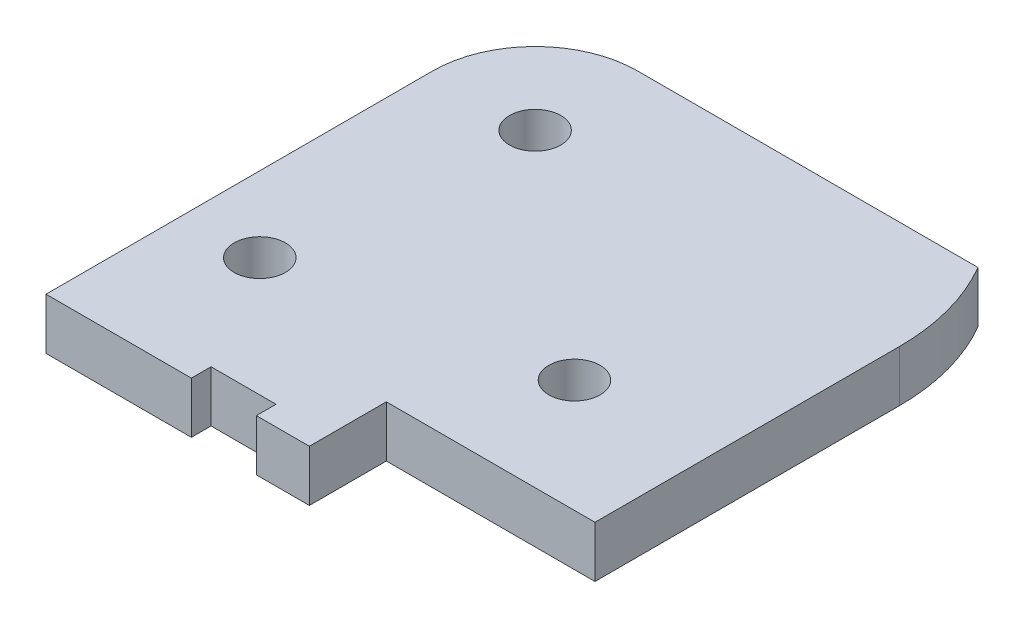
ISO-10303-21;
HEADER;
FILE_DESCRIPTION(('STEP AP214'),'2;1');
FILE_NAME('part.step','',(''),(''),'','','');
FILE_SCHEMA(('AUTOMOTIVE_DESIGN { 1 0 10303 214 1 1 1 1 }'));
ENDSEC;
DATA;
#1=APPLICATION_CONTEXT('core data for automotive mechanical design processes');
#2=APPLICATION_PROTOCOL_DEFINITION('international standard','automotive_design',2000,#1);
#3=PRODUCT_CONTEXT('',#1,'mechanical');
#4=PRODUCT('Part','Part','',(#3));
#5=PRODUCT_RELATED_PRODUCT_CATEGORY('part','',(#4));
#6=PRODUCT_DEFINITION_FORMATION('','',#4);
#7=PRODUCT_DEFINITION_CONTEXT('part definition',#1,'design');
#8=PRODUCT_DEFINITION('design','',#6,#7);
#9=PRODUCT_DEFINITION_SHAPE('','',#8);
#10=(LENGTH_UNIT() NAMED_UNIT(*) SI_UNIT(.MILLI.,.METRE.));
#11=(NAMED_UNIT(*) PLANE_ANGLE_UNIT() SI_UNIT($,.RADIAN.));
#12=(NAMED_UNIT(*) SI_UNIT($,.STERADIAN.) SOLID_ANGLE_UNIT());
#13=UNCERTAINTY_MEASURE_WITH_UNIT(LENGTH_MEASURE(1.E-05),#10,'distance_accuracy_value','');
#14=(GEOMETRIC_REPRESENTATION_CONTEXT(3) GLOBAL_UNCERTAINTY_ASSIGNED_CONTEXT((#13)) GLOBAL_UNIT_ASSIGNED_CONTEXT((#10,
#11,#12)) REPRESENTATION_CONTEXT('',''));
#15=CARTESIAN_POINT('',(0.,0.,0.));
#16=DIRECTION('',(0.,0.,1.));
#17=DIRECTION('',(1.,0.,0.));
#18=AXIS2_PLACEMENT_3D('',#15,#16,#17);
#19=CARTESIAN_POINT('',(-5.3,-1.5,14.3));
#20=DIRECTION('',(1.,0.,0.));
#21=DIRECTION('',(0.,0.,-1.));
#22=AXIS2_PLACEMENT_3D('',#19,#20,#21);
#23=PLANE('',#22);
#24=DIRECTION('',(0.,1.,0.));
#25=VECTOR('',#24,1.);
#26=CARTESIAN_POINT('',(-5.3,-1.5,14.3));
#27=LINE('',#26,#25);
#28=CARTESIAN_POINT('',(-5.3,-1.5,14.3));
#29=VERTEX_POINT('',#28);
#30=CARTESIAN_POINT('',(-5.3,1.5,14.3));
#31=VERTEX_POINT('',#30);
#32=EDGE_CURVE('E169',#29,#31,#27,.T.);
#33=ORIENTED_EDGE('',*,*,#32,.F.);
#34=DIRECTION('',(0.,0.,-1.));
#35=VECTOR('',#34,1.);
#36=CARTESIAN_POINT('',(-5.3,-1.5,14.3));
#37=LINE('',#36,#35);
#38=CARTESIAN_POINT('',(-5.3,-1.5,13.15));
#39=VERTEX_POINT('',#38);
#40=EDGE_CURVE('E113',#29,#39,#37,.T.);
#41=ORIENTED_EDGE('',*,*,#40,.T.);
#42=DIRECTION('',(0.,1.,0.));
#43=VECTOR('',#42,1.);
#44=CARTESIAN_POINT('',(-5.3,-1.5,13.15));
#45=LINE('',#44,#43);
#46=CARTESIAN_POINT('',(-5.3,1.5,13.15));
#47=VERTEX_POINT('',#46);
#48=EDGE_CURVE('E198',#47,#39,#45,.F.);
#49=ORIENTED_EDGE('',*,*,#48,.F.);
#50=DIRECTION('',(0.,0.,1.));
#51=VECTOR('',#50,1.);
#52=CARTESIAN_POINT('',(-5.3,1.5,0.));
#53=LINE('',#52,#51);
#54=EDGE_CURVE('E203',#31,#47,#53,.F.);
#55=ORIENTED_EDGE('',*,*,#54,.F.);
#56=EDGE_LOOP('',(#33,#41,#49,#55));
#57=FACE_BOUND('',#56,.T.);
#58=ADVANCED_FACE('F17',(#57),#23,.T.);
#59=CARTESIAN_POINT('',(-1.5,-1.5,13.15));
#60=DIRECTION('',(-1.,0.,0.));
#61=DIRECTION('',(0.,0.,1.));
#62=AXIS2_PLACEMENT_3D('',#59,#60,#61);
#63=PLANE('',#62);
#64=DIRECTION('',(0.,1.,0.));
#65=VECTOR('',#64,1.);
#66=CARTESIAN_POINT('',(-1.5,-1.5,13.15));
#67=LINE('',#66,#65);
#68=CARTESIAN_POINT('',(-1.5,-1.5,13.15));
#69=VERTEX_POINT('',#68);
#70=CARTESIAN_POINT('',(-1.5,1.5,13.15));
#71=VERTEX_POINT('',#70);
#72=EDGE_CURVE('E181',#69,#71,#67,.T.);
#73=ORIENTED_EDGE('',*,*,#72,.F.);
#74=DIRECTION('',(0.,0.,1.));
#75=VECTOR('',#74,1.);
#76=CARTESIAN_POINT('',(-1.5,-1.5,13.15));
#77=LINE('',#76,#75);
#78=CARTESIAN_POINT('',(-1.5,-1.5,14.3));
#79=VERTEX_POINT('',#78);
#80=EDGE_CURVE('E201',#69,#79,#77,.T.);
#81=ORIENTED_EDGE('',*,*,#80,.T.);
#82=DIRECTION('',(0.,1.,0.));
#83=VECTOR('',#82,1.);
#84=CARTESIAN_POINT('',(-1.5,-1.5,14.3));
#85=LINE('',#84,#83);
#86=CARTESIAN_POINT('',(-1.5,1.5,14.3));
#87=VERTEX_POINT('',#86);
#88=EDGE_CURVE('E163',#87,#79,#85,.F.);
#89=ORIENTED_EDGE('',*,*,#88,.F.);
#90=DIRECTION('',(0.,0.,1.));
#91=VECTOR('',#90,1.);
#92=CARTESIAN_POINT('',(-1.5,1.5,0.));
#93=LINE('',#92,#91);
#94=EDGE_CURVE('E172',#71,#87,#93,.T.);
#95=ORIENTED_EDGE('',*,*,#94,.F.);
#96=EDGE_LOOP('',(#73,#81,#89,#95));
#97=FACE_BOUND('',#96,.T.);
#98=ADVANCED_FACE('F400',(#97),#63,.T.);
#99=CARTESIAN_POINT('',(0.,1.5,0.));
#100=DIRECTION('',(0.,1.,0.));
#101=DIRECTION('',(0.,0.,1.));
#102=AXIS2_PLACEMENT_3D('',#99,#100,#101);
#103=PLANE('',#102);
#104=CARTESIAN_POINT('',(-7.8,1.5,-8.3));
#105=DIRECTION('',(0.,1.,0.));
#106=DIRECTION('',(0.,0.,1.));
#107=AXIS2_PLACEMENT_3D('',#104,#105,#106);
#108=CIRCLE('',#107,1.5);
#109=CARTESIAN_POINT('',(-7.8,1.5,-6.8));
#110=VERTEX_POINT('',#109);
#111=EDGE_CURVE('E244',#110,#110,#108,.F.);
#112=ORIENTED_EDGE('',*,*,#111,.T.);
#113=EDGE_LOOP('',(#112));
#114=FACE_BOUND('',#113,.T.);
#115=CARTESIAN_POINT('',(-9.4,1.5,6.2));
#116=DIRECTION('',(0.,1.,0.));
#117=DIRECTION('',(0.,0.,1.));
#118=AXIS2_PLACEMENT_3D('',#115,#116,#117);
#119=CIRCLE('',#118,1.5);
#120=CARTESIAN_POINT('',(-9.4,1.5,7.7));
#121=VERTEX_POINT('',#120);
#122=EDGE_CURVE('E247',#121,#121,#119,.F.);
#123=ORIENTED_EDGE('',*,*,#122,.T.);
#124=EDGE_LOOP('',(#123));
#125=FACE_BOUND('',#124,.T.);
#126=CARTESIAN_POINT('',(6.,1.5,3.2));
#127=DIRECTION('',(0.,1.,0.));
#128=DIRECTION('',(0.,0.,1.));
#129=AXIS2_PLACEMENT_3D('',#126,#127,#128);
#130=CIRCLE('',#129,1.5);
#131=CARTESIAN_POINT('',(6.,1.5,4.7));
#132=VERTEX_POINT('',#131);
#133=EDGE_CURVE('E250',#132,#132,#130,.F.);
#134=ORIENTED_EDGE('',*,*,#133,.T.);
#135=EDGE_LOOP('',(#134));
#136=FACE_BOUND('',#135,.T.);
#137=DIRECTION('',(0.,0.,1.));
#138=VECTOR('',#137,1.);
#139=CARTESIAN_POINT('',(-13.8,1.5,-8.3));
#140=LINE('',#139,#138);
#141=CARTESIAN_POINT('',(-13.8,1.5,14.3));
#142=VERTEX_POINT('',#141);
#143=CARTESIAN_POINT('',(-13.8,1.5,-8.3));
#144=VERTEX_POINT('',#143);
#145=EDGE_CURVE('E175',#142,#144,#140,.F.);
#146=ORIENTED_EDGE('',*,*,#145,.F.);
#147=DIRECTION('',(1.,0.,0.));
#148=VECTOR('',#147,1.);
#149=CARTESIAN_POINT('',(-13.8,1.5,14.3));
#150=LINE('',#149,#148);
#151=EDGE_CURVE('E171',#31,#142,#150,.F.);
#152=ORIENTED_EDGE('',*,*,#151,.F.);
#153=ORIENTED_EDGE('',*,*,#54,.T.);
#154=DIRECTION('',(1.,0.,0.));
#155=VECTOR('',#154,1.);
#156=CARTESIAN_POINT('',(-5.3,1.5,13.15));
#157=LINE('',#156,#155);
#158=EDGE_CURVE('E216',#71,#47,#157,.F.);
#159=ORIENTED_EDGE('',*,*,#158,.F.);
#160=ORIENTED_EDGE('',*,*,#94,.T.);
#161=DIRECTION('',(1.,0.,0.));
#162=VECTOR('',#161,1.);
#163=CARTESIAN_POINT('',(-1.5,1.5,14.3));
#164=LINE('',#163,#162);
#165=CARTESIAN_POINT('',(1.6,1.5,14.3));
#166=VERTEX_POINT('',#165);
#167=EDGE_CURVE('E166',#166,#87,#164,.F.);
#168=ORIENTED_EDGE('',*,*,#167,.F.);
#169=DIRECTION('',(0.,0.,-1.));
#170=VECTOR('',#169,1.);
#171=CARTESIAN_POINT('',(1.6,1.5,14.3));
#172=LINE('',#171,#170);
#173=CARTESIAN_POINT('',(1.6,1.5,9.8));
#174=VERTEX_POINT('',#173);
#175=EDGE_CURVE('E158',#174,#166,#172,.F.);
#176=ORIENTED_EDGE('',*,*,#175,.F.);
#177=DIRECTION('',(1.,0.,0.));
#178=VECTOR('',#177,1.);
#179=CARTESIAN_POINT('',(1.6,1.5,9.8));
#180=LINE('',#179,#178);
#181=CARTESIAN_POINT('',(13.8,1.5,9.8));
#182=VERTEX_POINT('',#181);
#183=EDGE_CURVE('E131',#182,#174,#180,.F.);
#184=ORIENTED_EDGE('',*,*,#183,.F.);
#185=DIRECTION('',(0.,0.,-1.));
#186=VECTOR('',#185,1.);
#187=CARTESIAN_POINT('',(13.8,1.5,9.8));
#188=LINE('',#187,#186);
#189=CARTESIAN_POINT('',(13.8,1.5,-8.));
#190=VERTEX_POINT('',#189);
#191=EDGE_CURVE('E72',#190,#182,#188,.F.);
#192=ORIENTED_EDGE('',*,*,#191,.F.);
#193=CARTESIAN_POINT('',(1.3,1.5,-8.));
#194=DIRECTION('',(0.,1.,0.));
#195=DIRECTION('',(0.,0.,1.));
#196=AXIS2_PLACEMENT_3D('',#193,#194,#195);
#197=CIRCLE('',#196,12.5);
#198=CARTESIAN_POINT('',(12.0962956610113,1.5,-14.3));
#199=VERTEX_POINT('',#198);
#200=EDGE_CURVE('E20',#199,#190,#197,.F.);
#201=ORIENTED_EDGE('',*,*,#200,.F.);
#202=DIRECTION('',(-1.,0.,0.));
#203=VECTOR('',#202,1.);
#204=CARTESIAN_POINT('',(12.09629566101,1.5,-14.3));
#205=LINE('',#204,#203);
#206=CARTESIAN_POINT('',(-7.8,1.5,-14.3));
#207=VERTEX_POINT('',#206);
#208=EDGE_CURVE('E59',#207,#199,#205,.F.);
#209=ORIENTED_EDGE('',*,*,#208,.F.);
#210=CARTESIAN_POINT('',(-7.8,1.5,-8.3));
#211=DIRECTION('',(0.,1.,0.));
#212=DIRECTION('',(0.,0.,1.));
#213=AXIS2_PLACEMENT_3D('',#210,#211,#212);
#214=CIRCLE('',#213,6.);
#215=EDGE_CURVE('E252',#144,#207,#214,.F.);
#216=ORIENTED_EDGE('',*,*,#215,.F.);
#217=EDGE_LOOP('',(#146,#152,#153,#159,#160,#168,#176,#184,#192,#201,#209,#216));
#218=FACE_BOUND('',#217,.T.);
#219=ADVANCED_FACE('F393',(#114,#125,#136,#218),#103,.T.);
#220=CARTESIAN_POINT('',(-13.8,-1.5,14.3));
#221=DIRECTION('',(0.,0.,1.));
#222=DIRECTION('',(1.,0.,0.));
#223=AXIS2_PLACEMENT_3D('',#220,#221,#222);
#224=PLANE('',#223);
#225=DIRECTION('',(0.,1.,0.));
#226=VECTOR('',#225,1.);
#227=CARTESIAN_POINT('',(-13.8,-1.5,14.3));
#228=LINE('',#227,#226);
#229=CARTESIAN_POINT('',(-13.8,-1.5,14.3));
#230=VERTEX_POINT('',#229);
#231=EDGE_CURVE('E177',#230,#142,#228,.T.);
#232=ORIENTED_EDGE('',*,*,#231,.F.);
#233=DIRECTION('',(1.,0.,0.));
#234=VECTOR('',#233,1.);
#235=CARTESIAN_POINT('',(0.,-1.5,14.3));
#236=LINE('',#235,#234);
#237=EDGE_CURVE('E117',#230,#29,#236,.T.);
#238=ORIENTED_EDGE('',*,*,#237,.T.);
#239=ORIENTED_EDGE('',*,*,#32,.T.);
#240=ORIENTED_EDGE('',*,*,#151,.T.);
#241=EDGE_LOOP('',(#232,#238,#239,#240));
#242=FACE_BOUND('',#241,.T.);
#243=ADVANCED_FACE('F282',(#242),#224,.T.);
#244=CARTESIAN_POINT('',(-5.3,-1.5,13.15));
#245=DIRECTION('',(0.,0.,1.));
#246=DIRECTION('',(1.,0.,0.));
#247=AXIS2_PLACEMENT_3D('',#244,#245,#246);
#248=PLANE('',#247);
#249=ORIENTED_EDGE('',*,*,#48,.T.);
#250=DIRECTION('',(1.,0.,0.));
#251=VECTOR('',#250,1.);
#252=CARTESIAN_POINT('',(0.,-1.5,13.15));
#253=LINE('',#252,#251);
#254=EDGE_CURVE('E150',#39,#69,#253,.T.);
#255=ORIENTED_EDGE('',*,*,#254,.T.);
#256=ORIENTED_EDGE('',*,*,#72,.T.);
#257=ORIENTED_EDGE('',*,*,#158,.T.);
#258=EDGE_LOOP('',(#249,#255,#256,#257));
#259=FACE_BOUND('',#258,.T.);
#260=ADVANCED_FACE('F378',(#259),#248,.T.);
#261=CARTESIAN_POINT('',(-1.5,-1.5,14.3));
#262=DIRECTION('',(0.,0.,1.));
#263=DIRECTION('',(1.,0.,0.));
#264=AXIS2_PLACEMENT_3D('',#261,#262,#263);
#265=PLANE('',#264);
#266=ORIENTED_EDGE('',*,*,#88,.T.);
#267=DIRECTION('',(1.,0.,0.));
#268=VECTOR('',#267,1.);
#269=CARTESIAN_POINT('',(0.,-1.5,14.3));
#270=LINE('',#269,#268);
#271=CARTESIAN_POINT('',(1.6,-1.5,14.3));
#272=VERTEX_POINT('',#271);
#273=EDGE_CURVE('E148',#79,#272,#270,.T.);
#274=ORIENTED_EDGE('',*,*,#273,.T.);
#275=DIRECTION('',(0.,1.,0.));
#276=VECTOR('',#275,1.);
#277=CARTESIAN_POINT('',(1.6,-1.5,14.3));
#278=LINE('',#277,#276);
#279=EDGE_CURVE('E147',#166,#272,#278,.F.);
#280=ORIENTED_EDGE('',*,*,#279,.F.);
#281=ORIENTED_EDGE('',*,*,#167,.T.);
#282=EDGE_LOOP('',(#266,#274,#280,#281));
#283=FACE_BOUND('',#282,.T.);
#284=ADVANCED_FACE('F371',(#283),#265,.T.);
#285=CARTESIAN_POINT('',(1.6,-1.5,14.3));
#286=DIRECTION('',(1.,0.,0.));
#287=DIRECTION('',(0.,0.,-1.));
#288=AXIS2_PLACEMENT_3D('',#285,#286,#287);
#289=PLANE('',#288);
#290=ORIENTED_EDGE('',*,*,#279,.T.);
#291=DIRECTION('',(0.,0.,1.));
#292=VECTOR('',#291,1.);
#293=CARTESIAN_POINT('',(1.6,-1.5,0.));
#294=LINE('',#293,#292);
#295=CARTESIAN_POINT('',(1.6,-1.5,9.8));
#296=VERTEX_POINT('',#295);
#297=EDGE_CURVE('E140',#272,#296,#294,.F.);
#298=ORIENTED_EDGE('',*,*,#297,.T.);
#299=DIRECTION('',(0.,1.,0.));
#300=VECTOR('',#299,1.);
#301=CARTESIAN_POINT('',(1.6,-1.5,9.8));
#302=LINE('',#301,#300);
#303=EDGE_CURVE('E127',#174,#296,#302,.F.);
#304=ORIENTED_EDGE('',*,*,#303,.F.);
#305=ORIENTED_EDGE('',*,*,#175,.T.);
#306=EDGE_LOOP('',(#290,#298,#304,#305));
#307=FACE_BOUND('',#306,.T.);
#308=ADVANCED_FACE('F145',(#307),#289,.T.);
#309=CARTESIAN_POINT('',(1.6,-1.5,9.8));
#310=DIRECTION('',(0.,0.,1.));
#311=DIRECTION('',(1.,0.,0.));
#312=AXIS2_PLACEMENT_3D('',#309,#310,#311);
#313=PLANE('',#312);
#314=ORIENTED_EDGE('',*,*,#303,.T.);
#315=DIRECTION('',(1.,0.,0.));
#316=VECTOR('',#315,1.);
#317=CARTESIAN_POINT('',(0.,-1.5,9.8));
#318=LINE('',#317,#316);
#319=CARTESIAN_POINT('',(13.8,-1.5,9.8));
#320=VERTEX_POINT('',#319);
#321=EDGE_CURVE('E130',#296,#320,#318,.T.);
#322=ORIENTED_EDGE('',*,*,#321,.T.);
#323=DIRECTION('',(0.,1.,0.));
#324=VECTOR('',#323,1.);
#325=CARTESIAN_POINT('',(13.8,-1.5,9.8));
#326=LINE('',#325,#324);
#327=EDGE_CURVE('E121',#182,#320,#326,.F.);
#328=ORIENTED_EDGE('',*,*,#327,.F.);
#329=ORIENTED_EDGE('',*,*,#183,.T.);
#330=EDGE_LOOP('',(#314,#322,#328,#329));
#331=FACE_BOUND('',#330,.T.);
#332=ADVANCED_FACE('F129',(#331),#313,.T.);
#333=CARTESIAN_POINT('',(13.8,-1.5,9.8));
#334=DIRECTION('',(1.,0.,0.));
#335=DIRECTION('',(0.,0.,-1.));
#336=AXIS2_PLACEMENT_3D('',#333,#334,#335);
#337=PLANE('',#336);
#338=ORIENTED_EDGE('',*,*,#327,.T.);
#339=DIRECTION('',(0.,0.,1.));
#340=VECTOR('',#339,1.);
#341=CARTESIAN_POINT('',(13.8,-1.5,0.));
#342=LINE('',#341,#340);
#343=CARTESIAN_POINT('',(13.8,-1.5,-8.));
#344=VERTEX_POINT('',#343);
#345=EDGE_CURVE('E143',#320,#344,#342,.F.);
#346=ORIENTED_EDGE('',*,*,#345,.T.);
#347=DIRECTION('',(0.,1.,0.));
#348=VECTOR('',#347,1.);
#349=CARTESIAN_POINT('',(13.8,-1.5,-8.));
#350=LINE('',#349,#348);
#351=EDGE_CURVE('E186',#190,#344,#350,.F.);
#352=ORIENTED_EDGE('',*,*,#351,.F.);
#353=ORIENTED_EDGE('',*,*,#191,.T.);
#354=EDGE_LOOP('',(#338,#346,#352,#353));
#355=FACE_BOUND('',#354,.T.);
#356=ADVANCED_FACE('F268',(#355),#337,.T.);
#357=CARTESIAN_POINT('',(1.3,-1.5,-8.));
#358=DIRECTION('',(0.,1.,0.));
#359=DIRECTION('',(0.,0.,1.));
#360=AXIS2_PLACEMENT_3D('',#357,#358,#359);
#361=CYLINDRICAL_SURFACE('',#360,12.5);
#362=ORIENTED_EDGE('',*,*,#351,.T.);
#363=CARTESIAN_POINT('',(1.3,-1.5,-8.));
#364=DIRECTION('',(0.,1.,0.));
#365=DIRECTION('',(0.,0.,1.));
#366=AXIS2_PLACEMENT_3D('',#363,#364,#365);
#367=CIRCLE('',#366,12.5);
#368=CARTESIAN_POINT('',(12.0962956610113,-1.5,-14.3));
#369=VERTEX_POINT('',#368);
#370=EDGE_CURVE('E241',#344,#369,#367,.T.);
#371=ORIENTED_EDGE('',*,*,#370,.T.);
#372=DIRECTION('',(0.,1.,0.));
#373=VECTOR('',#372,1.);
#374=CARTESIAN_POINT('',(12.09629566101,-1.5,-14.3));
#375=LINE('',#374,#373);
#376=EDGE_CURVE('E185',#199,#369,#375,.F.);
#377=ORIENTED_EDGE('',*,*,#376,.F.);
#378=ORIENTED_EDGE('',*,*,#200,.T.);
#379=EDGE_LOOP('',(#362,#371,#377,#378));
#380=FACE_BOUND('',#379,.T.);
#381=ADVANCED_FACE('F267',(#380),#361,.T.);
#382=CARTESIAN_POINT('',(12.09629566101,-1.5,-14.3));
#383=DIRECTION('',(0.,0.,-1.));
#384=DIRECTION('',(-1.,0.,0.));
#385=AXIS2_PLACEMENT_3D('',#382,#383,#384);
#386=PLANE('',#385);
#387=ORIENTED_EDGE('',*,*,#376,.T.);
#388=DIRECTION('',(1.,0.,0.));
#389=VECTOR('',#388,1.);
#390=CARTESIAN_POINT('',(0.,-1.5,-14.3));
#391=LINE('',#390,#389);
#392=CARTESIAN_POINT('',(-7.8,-1.5,-14.3));
#393=VERTEX_POINT('',#392);
#394=EDGE_CURVE('E240',#369,#393,#391,.F.);
#395=ORIENTED_EDGE('',*,*,#394,.T.);
#396=DIRECTION('',(0.,1.,0.));
#397=VECTOR('',#396,1.);
#398=CARTESIAN_POINT('',(-7.8,-1.5,-14.3));
#399=LINE('',#398,#397);
#400=EDGE_CURVE('E253',#207,#393,#399,.F.);
#401=ORIENTED_EDGE('',*,*,#400,.F.);
#402=ORIENTED_EDGE('',*,*,#208,.T.);
#403=EDGE_LOOP('',(#387,#395,#401,#402));
#404=FACE_BOUND('',#403,.T.);
#405=ADVANCED_FACE('F290',(#404),#386,.T.);
#406=CARTESIAN_POINT('',(-7.8,-1.5,-8.3));
#407=DIRECTION('',(0.,1.,0.));
#408=DIRECTION('',(0.,0.,1.));
#409=AXIS2_PLACEMENT_3D('',#406,#407,#408);
#410=CYLINDRICAL_SURFACE('',#409,6.);
#411=ORIENTED_EDGE('',*,*,#400,.T.);
#412=CARTESIAN_POINT('',(-7.8,-1.5,-8.3));
#413=DIRECTION('',(0.,1.,0.));
#414=DIRECTION('',(0.,0.,1.));
#415=AXIS2_PLACEMENT_3D('',#412,#413,#414);
#416=CIRCLE('',#415,6.);
#417=CARTESIAN_POINT('',(-13.8,-1.5,-8.3));
#418=VERTEX_POINT('',#417);
#419=EDGE_CURVE('E237',#393,#418,#416,.T.);
#420=ORIENTED_EDGE('',*,*,#419,.T.);
#421=DIRECTION('',(0.,1.,0.));
#422=VECTOR('',#421,1.);
#423=CARTESIAN_POINT('',(-13.8,-1.5,-8.3));
#424=LINE('',#423,#422);
#425=EDGE_CURVE('E35',#144,#418,#424,.F.);
#426=ORIENTED_EDGE('',*,*,#425,.F.);
#427=ORIENTED_EDGE('',*,*,#215,.T.);
#428=EDGE_LOOP('',(#411,#420,#426,#427));
#429=FACE_BOUND('',#428,.T.);
#430=ADVANCED_FACE('F289',(#429),#410,.T.);
#431=CARTESIAN_POINT('',(-13.8,-1.5,-8.3));
#432=DIRECTION('',(-1.,0.,0.));
#433=DIRECTION('',(0.,0.,1.));
#434=AXIS2_PLACEMENT_3D('',#431,#432,#433);
#435=PLANE('',#434);
#436=ORIENTED_EDGE('',*,*,#425,.T.);
#437=DIRECTION('',(0.,0.,1.));
#438=VECTOR('',#437,1.);
#439=CARTESIAN_POINT('',(-13.8,-1.5,0.));
#440=LINE('',#439,#438);
#441=EDGE_CURVE('E236',#418,#230,#440,.T.);
#442=ORIENTED_EDGE('',*,*,#441,.T.);
#443=ORIENTED_EDGE('',*,*,#231,.T.);
#444=ORIENTED_EDGE('',*,*,#145,.T.);
#445=EDGE_LOOP('',(#436,#442,#443,#444));
#446=FACE_BOUND('',#445,.T.);
#447=ADVANCED_FACE('F286',(#446),#435,.T.);
#448=CARTESIAN_POINT('',(6.,-1.5,3.2));
#449=DIRECTION('',(0.,1.,0.));
#450=DIRECTION('',(0.,0.,1.));
#451=AXIS2_PLACEMENT_3D('',#448,#449,#450);
#452=CYLINDRICAL_SURFACE('',#451,1.5);
#453=ORIENTED_EDGE('',*,*,#133,.F.);
#454=EDGE_LOOP('',(#453));
#455=FACE_BOUND('',#454,.T.);
#456=CARTESIAN_POINT('',(6.,-1.5,3.2));
#457=DIRECTION('',(0.,1.,0.));
#458=DIRECTION('',(0.,0.,1.));
#459=AXIS2_PLACEMENT_3D('',#456,#457,#458);
#460=CIRCLE('',#459,1.5);
#461=CARTESIAN_POINT('',(6.,-1.5,4.7));
#462=VERTEX_POINT('',#461);
#463=EDGE_CURVE('E233',#462,#462,#460,.F.);
#464=ORIENTED_EDGE('',*,*,#463,.T.);
#465=EDGE_LOOP('',(#464));
#466=FACE_BOUND('',#465,.T.);
#467=ADVANCED_FACE('F315',(#455,#466),#452,.F.);
#468=CARTESIAN_POINT('',(-9.4,-1.5,6.2));
#469=DIRECTION('',(0.,1.,0.));
#470=DIRECTION('',(0.,0.,1.));
#471=AXIS2_PLACEMENT_3D('',#468,#469,#470);
#472=CYLINDRICAL_SURFACE('',#471,1.5);
#473=ORIENTED_EDGE('',*,*,#122,.F.);
#474=EDGE_LOOP('',(#473));
#475=FACE_BOUND('',#474,.T.);
#476=CARTESIAN_POINT('',(-9.4,-1.5,6.2));
#477=DIRECTION('',(0.,1.,0.));
#478=DIRECTION('',(0.,0.,1.));
#479=AXIS2_PLACEMENT_3D('',#476,#477,#478);
#480=CIRCLE('',#479,1.5);
#481=CARTESIAN_POINT('',(-9.4,-1.5,7.7));
#482=VERTEX_POINT('',#481);
#483=EDGE_CURVE('E26',#482,#482,#480,.F.);
#484=ORIENTED_EDGE('',*,*,#483,.T.);
#485=EDGE_LOOP('',(#484));
#486=FACE_BOUND('',#485,.T.);
#487=ADVANCED_FACE('F307',(#475,#486),#472,.F.);
#488=CARTESIAN_POINT('',(-7.8,-1.5,-8.3));
#489=DIRECTION('',(0.,1.,0.));
#490=DIRECTION('',(0.,0.,1.));
#491=AXIS2_PLACEMENT_3D('',#488,#489,#490);
#492=CYLINDRICAL_SURFACE('',#491,1.5);
#493=ORIENTED_EDGE('',*,*,#111,.F.);
#494=EDGE_LOOP('',(#493));
#495=FACE_BOUND('',#494,.T.);
#496=CARTESIAN_POINT('',(-7.8,-1.5,-8.3));
#497=DIRECTION('',(0.,1.,0.));
#498=DIRECTION('',(0.,0.,1.));
#499=AXIS2_PLACEMENT_3D('',#496,#497,#498);
#500=CIRCLE('',#499,1.5);
#501=CARTESIAN_POINT('',(-7.8,-1.5,-6.8));
#502=VERTEX_POINT('',#501);
#503=EDGE_CURVE('E11',#502,#502,#500,.F.);
#504=ORIENTED_EDGE('',*,*,#503,.T.);
#505=EDGE_LOOP('',(#504));
#506=FACE_BOUND('',#505,.T.);
#507=ADVANCED_FACE('F301',(#495,#506),#492,.F.);
#508=CARTESIAN_POINT('',(0.,-1.5,0.));
#509=DIRECTION('',(0.,1.,0.));
#510=DIRECTION('',(0.,0.,1.));
#511=AXIS2_PLACEMENT_3D('',#508,#509,#510);
#512=PLANE('',#511);
#513=ORIENTED_EDGE('',*,*,#503,.F.);
#514=EDGE_LOOP('',(#513));
#515=FACE_BOUND('',#514,.T.);
#516=ORIENTED_EDGE('',*,*,#483,.F.);
#517=EDGE_LOOP('',(#516));
#518=FACE_BOUND('',#517,.T.);
#519=ORIENTED_EDGE('',*,*,#463,.F.);
#520=EDGE_LOOP('',(#519));
#521=FACE_BOUND('',#520,.T.);
#522=ORIENTED_EDGE('',*,*,#419,.F.);
#523=ORIENTED_EDGE('',*,*,#394,.F.);
#524=ORIENTED_EDGE('',*,*,#370,.F.);
#525=ORIENTED_EDGE('',*,*,#345,.F.);
#526=ORIENTED_EDGE('',*,*,#321,.F.);
#527=ORIENTED_EDGE('',*,*,#297,.F.);
#528=ORIENTED_EDGE('',*,*,#273,.F.);
#529=ORIENTED_EDGE('',*,*,#80,.F.);
#530=ORIENTED_EDGE('',*,*,#254,.F.);
#531=ORIENTED_EDGE('',*,*,#40,.F.);
#532=ORIENTED_EDGE('',*,*,#237,.F.);
#533=ORIENTED_EDGE('',*,*,#441,.F.);
#534=EDGE_LOOP('',(#522,#523,#524,#525,#526,#527,#528,#529,#530,#531,#532,#533));
#535=FACE_BOUND('',#534,.T.);
#536=ADVANCED_FACE('F138',(#515,#518,#521,#535),#512,.F.);
#537=CLOSED_SHELL('',(#58,#98,#219,#243,#260,#284,#308,#332,#356,#381,#405,#430,#447,#467,#487,
#507,#536));
#538=MANIFOLD_SOLID_BREP('B1',#537);
#539=ADVANCED_BREP_SHAPE_REPRESENTATION('',(#18,#538),#14);
#540=SHAPE_DEFINITION_REPRESENTATION(#9,#539);
ENDSEC;
END-ISO-10303-21;
